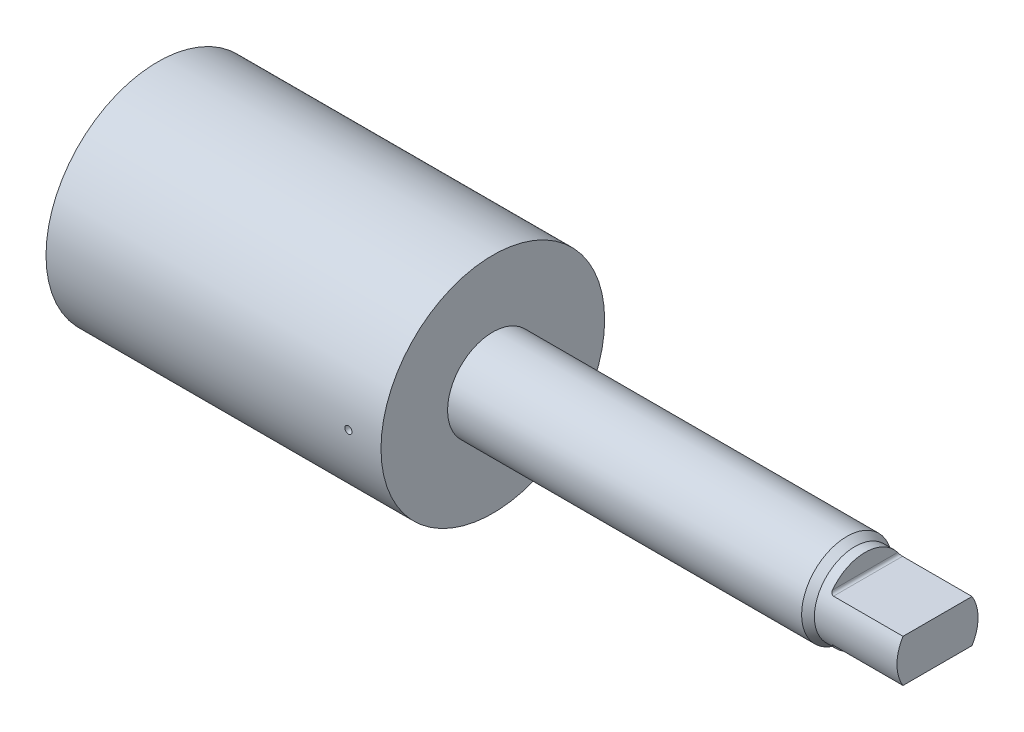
from build123d import *

# Parameters (mm, degrees)
SKETCH2_W                        = 6.35
SKETCH2_H                        = 1.6891
CUT_EXTRUDE1_DEPTH               = 6.35
FILLET2_R                        = 0.254
F_72_0_025_DIAMETER_HOLE2_REACH  = 49.242
F_72_0_025_DIAMETER_HOLE2_BORE_R = 0.3175


with BuildPart() as part:
    # Sketch1 → Revolve1 (revolve)
    with BuildSketch(Plane.XY, mode=Mode.PRIVATE) as revolve1_sk:
        Polygon((29.37, 3.96621), (60.409495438, 3.96621), (61.12, 3.556), (68.359, 3.556), (68.359, 0), (26.83, 0), (26.83, 5.9944), (0, 5.9944), (0, 9.8044), (29.37, 9.8044), align=None)
    revolve(revolve1_sk.sketch.rotate(Axis((-2.971836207, 0, 0), (1, 0, 0)), 90), axis=Axis((-2.971836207, 0, 0), (1, 0, 0)))

    # Sketch2 → Cut-Extrude1 (cut, symmetric)
    with BuildSketch(Plane.XY):
        with Locations((65.184, 2.71145)):
            Rectangle(SKETCH2_W, SKETCH2_H)
        with Locations((65.184, -2.71145)):
            Rectangle(SKETCH2_W, SKETCH2_H)
    extrude(amount=CUT_EXTRUDE1_DEPTH, both=True, mode=Mode.SUBTRACT)

    # Fillet2
    fillet2_edges = [part.edges().sort_by_distance(p)[0] for p in [
        (62.009, 1.8669, 0),
        (62.009, -1.8669, 0),
    ]]
    fillet(fillet2_edges, radius=FILLET2_R)

    # 72 _0.025_ Diameter Hole2 bore (on position points) → 72 _0.025_ Diameter Hole2 (cut, up to next)
    with BuildSketch(Plane(origin=(26.5125, 0, 9.8044), x_dir=(1, 0, 0), z_dir=(0, 0, 1)), mode=Mode.PRIVATE) as f_72_0_025_diameter_hole2_sk1:
        Circle(F_72_0_025_DIAMETER_HOLE2_BORE_R)
    f_72_0_025_diameter_hole2_tool1 = extrude(f_72_0_025_diameter_hole2_sk1.sketch, amount=-F_72_0_025_DIAMETER_HOLE2_REACH, mode=Mode.PRIVATE) & part.part
    add(f_72_0_025_diameter_hole2_tool1.solids().sort_by_distance((26.5125, 0, 9.8044))[0], mode=Mode.SUBTRACT)


solid = part.part
